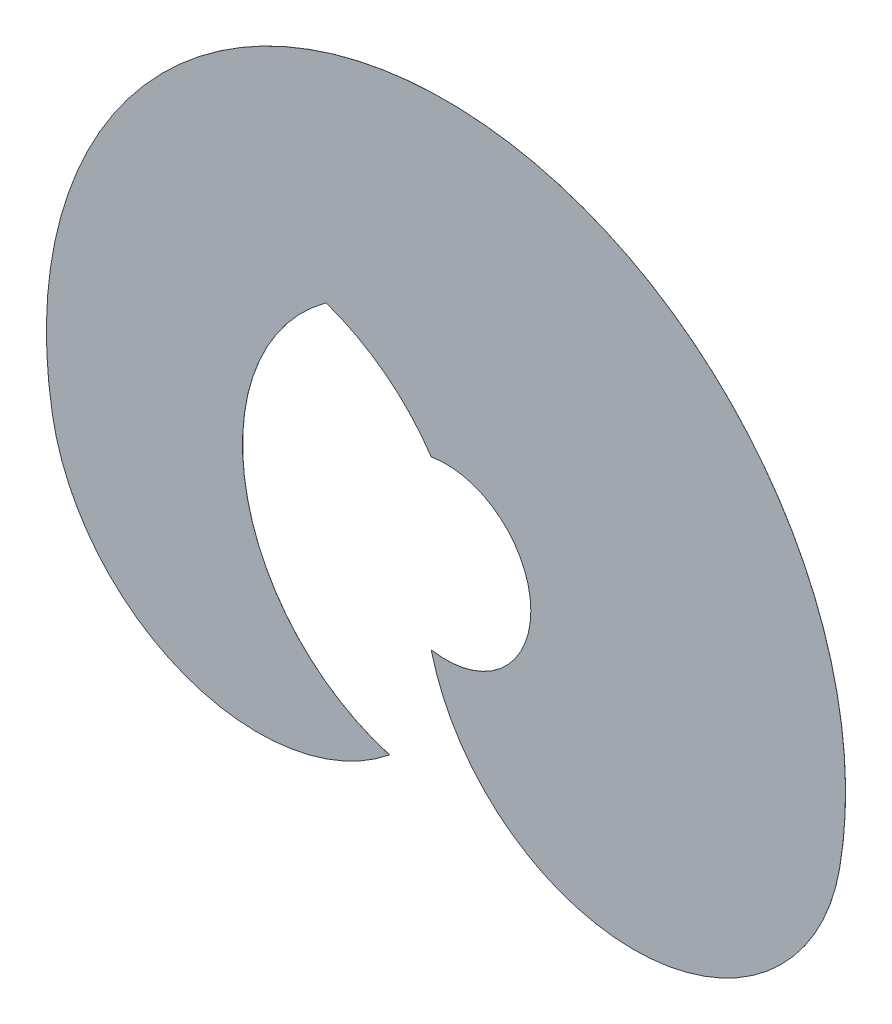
from build123d import *

# Parameters (mm, degrees)
EXTRUDE_1_DEPTH = 0.5


with BuildPart() as part:
    # Sketch 1 → Extrude 1 (new body)
    with BuildSketch(Plane.XY):
        with BuildLine():
            ThreePointArc((2663.480859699, 181.438207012), (250, 3057.712692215), (-2163.480859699, 181.438207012))
            ThreePointArc((-2163.480859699, 181.438207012), (-1350.904926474, -795.714693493), (-96.519990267, -591.690503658))
            ThreePointArc((-96.519990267, -591.690503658), (-978.815564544, 390.326661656), (-485.598575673, 1614.883804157))
            ThreePointArc((-485.598575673, 1614.883804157), (-122.576582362, 1419.889324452), (159.730627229, 1119.705290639))
            ThreePointArc((159.730627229, 1119.705290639), (770.591257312, 606.867638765), (159.469926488, 94.340677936))
            ThreePointArc((159.469926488, 94.340677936), (1446.745441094, -876.107013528), (2663.480859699, 181.438207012))
        make_face()
    extrude(amount=EXTRUDE_1_DEPTH)


solid = part.part
